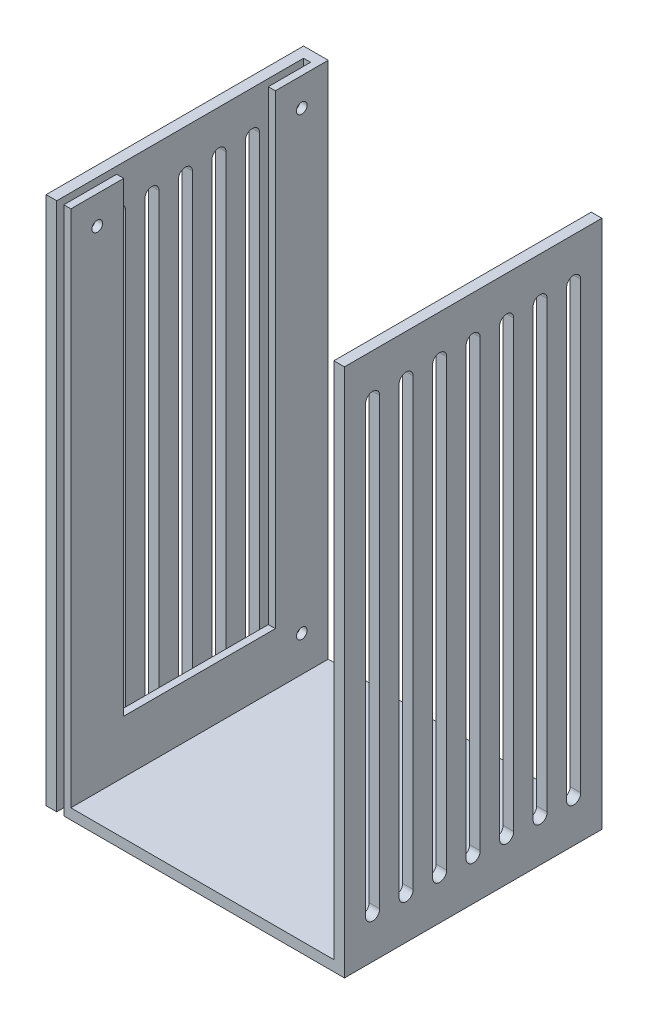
from build123d import *

# Parameters (mm, degrees)
SALIENTE_EXTRUIR2_DEPTH        = 150.1
CROQUIS4_W                     = 3
CROQUIS4_H                     = 73
SALIENTE_EXTRUIR2_2_DEPTH      = 150.1
CORTAR_EXTRUIR1_DEPTH          = 3
CORTAR_EXTRUIR2_START          = -3
CORTAR_EXTRUIR2_DEPTH          = 3
CROQUIS18_W                    = 1.5
CROQUIS18_H                    = 5
F_3_0MM_DOWEL_HOLE1_AT_2_COUNT = 2
F_3_0MM_DOWEL_HOLE1_AT_2_PITCH = 58
F_3_0MM_DOWEL_HOLE1_AT_3_COUNT = 2
F_3_0MM_DOWEL_HOLE1_AT_3_PITCH = 141.439032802
CROQUIS19_W                    = 74.6
CROQUIS19_H                    = 73
SALIENTE_EXTRUIR3_DEPTH        = 3
CROQUIS20_W                    = 43
CROQUIS20_H                    = 132.1
CORTAR_EXTRUIR3_DEPTH          = 2


with BuildPart() as part:
    # Croquis4 → Saliente-Extruir2 (new body)
    with BuildSketch(Plane(origin=(0, 0, 0), x_dir=(1, 0, 0), z_dir=(0, 1, 0))):
        Polygon((-528.36205916, 42.30707391), (-535.36205916, 42.30707391), (-535.36205916, -30.69292609), (-532.36205916, -30.69292609), (-532.36205916, 39.30707391), (-530.36205916, 39.30707391), (-530.36205916, -30.69292609), (-528.36205916, -30.69292609), align=None)
    extrude(amount=SALIENTE_EXTRUIR2_DEPTH)

    # Croquis6 → Cortar-Extruir1 (cut)
    with BuildSketch(Plane.ZY.offset(535.36205916)):
        with BuildLine():
            Line((-36.30707391, 138.1), (-36.30707391, 12))
            ThreePointArc((-36.30707391, 12), (-34.30707391, 10), (-32.30707391, 12))
            Line((-32.30707391, 12), (-32.30707391, 138.1))
            ThreePointArc((-32.30707391, 138.1), (-34.30707391, 140.1), (-36.30707391, 138.1))
        make_face()
        with BuildLine():
            Line((-26.80707391, 138.1), (-26.80707391, 12))
            ThreePointArc((-26.80707391, 12), (-24.80707391, 10), (-22.80707391, 12))
            Line((-22.80707391, 12), (-22.80707391, 138.1))
            ThreePointArc((-22.80707391, 138.1), (-24.80707391, 140.1), (-26.80707391, 138.1))
        make_face()
        with BuildLine():
            Line((-7.80707391, 138.1), (-7.80707391, 12))
            ThreePointArc((-7.80707391, 12), (-5.80707391, 10), (-3.80707391, 12))
            Line((-3.80707391, 12), (-3.80707391, 138.1))
            ThreePointArc((-3.80707391, 138.1), (-5.80707391, 140.1), (-7.80707391, 138.1))
        make_face()
        with BuildLine():
            Line((-17.30707391, 138.1), (-17.30707391, 12))
            ThreePointArc((-17.30707391, 12), (-15.30707391, 10), (-13.30707391, 12))
            Line((-13.30707391, 12), (-13.30707391, 138.1))
            ThreePointArc((-13.30707391, 138.1), (-15.30707391, 140.1), (-17.30707391, 138.1))
        make_face()
        with BuildLine():
            Line((20.69292609, 138.1), (20.69292609, 12))
            ThreePointArc((20.69292609, 12), (22.69292609, 10), (24.69292609, 12))
            Line((24.69292609, 12), (24.69292609, 138.1))
            ThreePointArc((24.69292609, 138.1), (22.69292609, 140.1), (20.69292609, 138.1))
        make_face()
        with BuildLine():
            Line((15.19292609, 138.1), (15.19292609, 12))
            ThreePointArc((15.19292609, 12), (13.19292609, 10), (11.19292609, 12))
            Line((11.19292609, 12), (11.19292609, 138.1))
            ThreePointArc((11.19292609, 138.1), (13.19292609, 140.1), (15.19292609, 138.1))
        make_face()
        with BuildLine():
            Line((1.69292609, 138.1), (1.69292609, 12))
            ThreePointArc((1.69292609, 12), (3.69292609, 10), (5.69292609, 12))
            Line((5.69292609, 12), (5.69292609, 138.1))
            ThreePointArc((5.69292609, 138.1), (3.69292609, 140.1), (1.69292609, 138.1))
        make_face()
    extrude(amount=-CORTAR_EXTRUIR1_DEPTH, mode=Mode.SUBTRACT)

    # Croquis18 → 3.0mm Dowel Hole1 (revolve, cut)
    with BuildSketch(Plane(origin=(-528.36205916, 142.1, 23.19292609), x_dir=(0, 0, -1), z_dir=(0, 1, 0))):
        with Locations((0.75, 2.5)):
            Rectangle(CROQUIS18_W, CROQUIS18_H)
    f_3_0mm_dowel_hole1 = revolve(axis=Axis((-522.01205916, 142.1, 23.19292609), (-1, 0, 0)), mode=Mode.SUBTRACT)

    # 3.0mm Dowel Hole1 at 2: 3.0mm Dowel Hole1 ×2
    with Locations(*[(0, 0, -i * F_3_0MM_DOWEL_HOLE1_AT_2_PITCH) for i in range(1, F_3_0MM_DOWEL_HOLE1_AT_2_COUNT)]):
        add(f_3_0mm_dowel_hole1, mode=Mode.SUBTRACT)

    # 3.0mm Dowel Hole1 at 3: 3.0mm Dowel Hole1 ×2
    with Locations(*[Vector(0, -0.9120537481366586, -0.4100706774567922) * (i * F_3_0MM_DOWEL_HOLE1_AT_3_PITCH) for i in range(1, F_3_0MM_DOWEL_HOLE1_AT_3_COUNT)]):
        add(f_3_0mm_dowel_hole1, mode=Mode.SUBTRACT)



with BuildPart() as body_2:
    # Croquis4 → Saliente-Extruir2 2 (new body)
    with BuildSketch(Plane(origin=(0, 0, 0), x_dir=(1, 0, 0), z_dir=(0, 1, 0))):
        with Locations((-452.26205916, 5.80707391)):
            Rectangle(CROQUIS4_W, CROQUIS4_H)
    extrude(amount=SALIENTE_EXTRUIR2_2_DEPTH)

    # Croquis9 → Cortar-Extruir2 (cut)
    with BuildSketch(Plane(origin=(-450.76205916, 0, 0), x_dir=(0, 0, -1), z_dir=(1, 0, 0)).offset(CORTAR_EXTRUIR2_START)):
        with BuildLine():
            Line((-24.69292609, 138.1), (-24.69292609, 12))
            ThreePointArc((-24.69292609, 12), (-22.69292609, 10), (-20.69292609, 12))
            Line((-20.69292609, 12), (-20.69292609, 138.1))
            ThreePointArc((-20.69292609, 138.1), (-22.69292609, 140.1), (-24.69292609, 138.1))
        make_face()
        with BuildLine():
            Line((-15.19292609, 138.1), (-15.19292609, 12))
            ThreePointArc((-15.19292609, 12), (-13.19292609, 10), (-11.19292609, 12))
            Line((-11.19292609, 12), (-11.19292609, 138.1))
            ThreePointArc((-11.19292609, 138.1), (-13.19292609, 140.1), (-15.19292609, 138.1))
        make_face()
        with BuildLine():
            Line((3.80707391, 138.1), (3.80707391, 12))
            ThreePointArc((3.80707391, 12), (5.80707391, 10), (7.80707391, 12))
            Line((7.80707391, 12), (7.80707391, 138.1))
            ThreePointArc((7.80707391, 138.1), (5.80707391, 140.1), (3.80707391, 138.1))
        make_face()
        with BuildLine():
            Line((-5.69292609, 138.1), (-5.69292609, 12))
            ThreePointArc((-5.69292609, 12), (-3.69292609, 10), (-1.69292609, 12))
            Line((-1.69292609, 12), (-1.69292609, 138.1))
            ThreePointArc((-1.69292609, 138.1), (-3.69292609, 140.1), (-5.69292609, 138.1))
        make_face()
        with BuildLine():
            Line((32.30707391, 138.1), (32.30707391, 12))
            ThreePointArc((32.30707391, 12), (34.30707391, 10), (36.30707391, 12))
            Line((36.30707391, 12), (36.30707391, 138.1))
            ThreePointArc((36.30707391, 138.1), (34.30707391, 140.1), (32.30707391, 138.1))
        make_face()
        with BuildLine():
            Line((26.80707391, 138.1), (26.80707391, 12))
            ThreePointArc((26.80707391, 12), (24.80707391, 10), (22.80707391, 12))
            Line((22.80707391, 12), (22.80707391, 138.1))
            ThreePointArc((22.80707391, 138.1), (24.80707391, 140.1), (26.80707391, 138.1))
        make_face()
        with BuildLine():
            Line((13.30707391, 138.1), (13.30707391, 12))
            ThreePointArc((13.30707391, 12), (15.30707391, 10), (17.30707391, 12))
            Line((17.30707391, 12), (17.30707391, 138.1))
            ThreePointArc((17.30707391, 138.1), (15.30707391, 140.1), (13.30707391, 138.1))
        make_face()
    extrude(amount=CORTAR_EXTRUIR2_DEPTH, mode=Mode.SUBTRACT)


with BuildPart() as part_1:
    add(part.part)

    add(body_2.part)  # Saliente-Extruir3 merges body 2
    # Croquis19 → Saliente-Extruir3 (add)
    with BuildSketch(Plane.XZ):
        with Locations((-491.06205916, -5.80707391)):
            Rectangle(CROQUIS19_W, CROQUIS19_H)
    extrude(amount=-SALIENTE_EXTRUIR3_DEPTH)

    # Croquis20 → Cortar-Extruir3 (cut)
    with BuildSketch(Plane(origin=(-528.36205916, 0, 0), x_dir=(0, 0, -1), z_dir=(1, 0, 0))):
        with Locations((5.80707391, 84.05)):
            Rectangle(CROQUIS20_W, CROQUIS20_H)
    extrude(amount=-CORTAR_EXTRUIR3_DEPTH, mode=Mode.SUBTRACT)


solid = part_1.part
